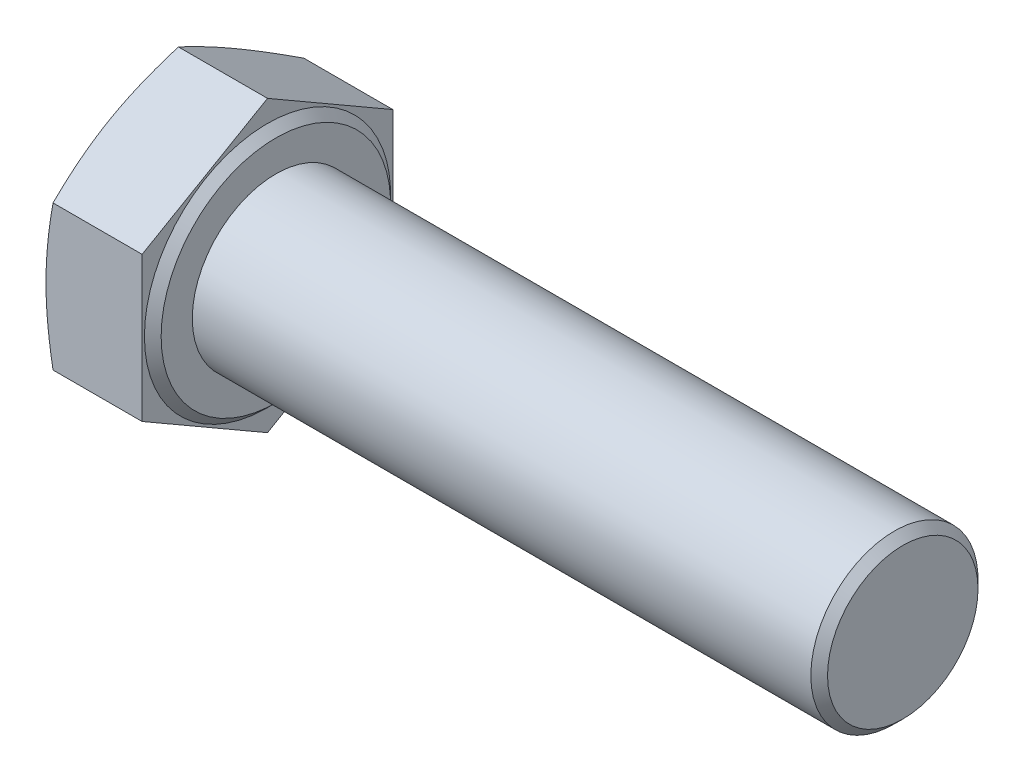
ISO-10303-21;
HEADER;
FILE_DESCRIPTION(('STEP AP214'),'2;1');
FILE_NAME('part.step','',(''),(''),'','','');
FILE_SCHEMA(('AUTOMOTIVE_DESIGN { 1 0 10303 214 1 1 1 1 }'));
ENDSEC;
DATA;
#1=APPLICATION_CONTEXT('core data for automotive mechanical design processes');
#2=APPLICATION_PROTOCOL_DEFINITION('international standard','automotive_design',2000,#1);
#3=PRODUCT_CONTEXT('',#1,'mechanical');
#4=PRODUCT('Part','Part','',(#3));
#5=PRODUCT_RELATED_PRODUCT_CATEGORY('part','',(#4));
#6=PRODUCT_DEFINITION_FORMATION('','',#4);
#7=PRODUCT_DEFINITION_CONTEXT('part definition',#1,'design');
#8=PRODUCT_DEFINITION('design','',#6,#7);
#9=PRODUCT_DEFINITION_SHAPE('','',#8);
#10=(LENGTH_UNIT() NAMED_UNIT(*) SI_UNIT(.MILLI.,.METRE.));
#11=(NAMED_UNIT(*) PLANE_ANGLE_UNIT() SI_UNIT($,.RADIAN.));
#12=(NAMED_UNIT(*) SI_UNIT($,.STERADIAN.) SOLID_ANGLE_UNIT());
#13=UNCERTAINTY_MEASURE_WITH_UNIT(LENGTH_MEASURE(1.E-05),#10,'distance_accuracy_value','');
#14=(GEOMETRIC_REPRESENTATION_CONTEXT(3) GLOBAL_UNCERTAINTY_ASSIGNED_CONTEXT((#13)) GLOBAL_UNIT_ASSIGNED_CONTEXT((#10,
#11,#12)) REPRESENTATION_CONTEXT('',''));
#15=CARTESIAN_POINT('',(0.,0.,0.));
#16=DIRECTION('',(0.,0.,1.));
#17=DIRECTION('',(1.,0.,0.));
#18=AXIS2_PLACEMENT_3D('',#15,#16,#17);
#19=CARTESIAN_POINT('',(7.5,0.,18.));
#20=DIRECTION('',(-1.,0.,0.));
#21=DIRECTION('',(0.,0.,1.));
#22=AXIS2_PLACEMENT_3D('',#19,#20,#21);
#23=PLANE('',#22);
#24=CARTESIAN_POINT('',(7.5,0.,0.));
#25=DIRECTION('',(-1.,0.,0.));
#26=DIRECTION('',(0.,0.,1.));
#27=AXIS2_PLACEMENT_3D('',#24,#25,#26);
#28=CIRCLE('',#27,8.235);
#29=CARTESIAN_POINT('',(7.5,0.,8.235));
#30=VERTEX_POINT('',#29);
#31=EDGE_CURVE('E273',#30,#30,#28,.T.);
#32=ORIENTED_EDGE('',*,*,#31,.F.);
#33=EDGE_LOOP('',(#32));
#34=FACE_BOUND('',#33,.T.);
#35=CARTESIAN_POINT('',(7.5,0.,0.));
#36=DIRECTION('',(-1.,0.,0.));
#37=DIRECTION('',(0.,0.,1.));
#38=AXIS2_PLACEMENT_3D('',#35,#36,#37);
#39=CIRCLE('',#38,6.);
#40=CARTESIAN_POINT('',(7.50000000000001,0.,6.));
#41=VERTEX_POINT('',#40);
#42=EDGE_CURVE('E157',#41,#41,#39,.F.);
#43=ORIENTED_EDGE('',*,*,#42,.F.);
#44=EDGE_LOOP('',(#43));
#45=FACE_BOUND('',#44,.T.);
#46=ADVANCED_FACE('F39',(#34,#45),#23,.F.);
#47=CARTESIAN_POINT('',(7.5,-5.19615242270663,9.));
#48=DIRECTION('',(0.,0.866025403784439,-0.5));
#49=DIRECTION('',(0.,0.5,0.866025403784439));
#50=AXIS2_PLACEMENT_3D('',#47,#48,#49);
#51=PLANE('',#50);
#52=CARTESIAN_POINT('',(0.506799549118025,-10.3924203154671,-0.00019999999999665));
#53=CARTESIAN_POINT('',(0.42844711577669,-10.1772266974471,0.372526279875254));
#54=CARTESIAN_POINT('',(0.357172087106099,-9.96132347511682,0.74648163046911));
#55=CARTESIAN_POINT('',(0.231774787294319,-9.52811323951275,1.49682376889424));
#56=CARTESIAN_POINT('',(0.177665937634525,-9.31080526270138,1.87321222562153));
#57=CARTESIAN_POINT('',(0.0901464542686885,-8.87719707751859,2.62424363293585));
#58=CARTESIAN_POINT('',(0.0565449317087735,-8.66090677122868,2.99886943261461));
#59=CARTESIAN_POINT('',(0.0114758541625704,-8.22782037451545,3.74899707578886));
#60=CARTESIAN_POINT('',(0.,-8.0110245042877,4.12449853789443));
#61=CARTESIAN_POINT('',(0.,-7.5774327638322,4.87550146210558));
#62=CARTESIAN_POINT('',(0.0114758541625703,-7.36063689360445,5.25100292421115));
#63=CARTESIAN_POINT('',(0.0565449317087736,-6.92755049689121,6.0011305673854));
#64=CARTESIAN_POINT('',(0.0901464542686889,-6.71126019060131,6.37575636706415));
#65=CARTESIAN_POINT('',(0.177665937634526,-6.27765200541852,7.12678777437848));
#66=CARTESIAN_POINT('',(0.23177478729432,-6.06034402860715,7.50317623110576));
#67=CARTESIAN_POINT('',(0.357172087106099,-5.62713379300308,8.25351836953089));
#68=CARTESIAN_POINT('',(0.428447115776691,-5.41123057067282,8.62747372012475));
#69=CARTESIAN_POINT('',(0.506799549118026,-5.19603695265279,9.0002));
#70=B_SPLINE_CURVE_WITH_KNOTS('',3,(#52,#53,#54,#55,#56,#57,#58,#59,#60,#61,#62,#63,#64,#65,#66,
#67,#68,#69),.UNSPECIFIED.,.F.,.F.,(4,2,2,2,2,2,2,2,4),(0.,1.3125188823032,2.62606145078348,
3.92718284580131,5.22781610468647,6.52844936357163,7.82957075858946,9.14311332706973,
10.4556322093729),.UNSPECIFIED.);
#71=CARTESIAN_POINT('',(0.506757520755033,-10.3923048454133,0.));
#72=VERTEX_POINT('',#71);
#73=CARTESIAN_POINT('',(0.,-7.79422863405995,4.5));
#74=VERTEX_POINT('',#73);
#75=EDGE_CURVE('E287',#72,#74,#70,.T.);
#76=ORIENTED_EDGE('',*,*,#75,.F.);
#77=DIRECTION('',(-1.,0.,0.));
#78=VECTOR('',#77,1.);
#79=CARTESIAN_POINT('',(7.5,-10.3923048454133,0.));
#80=LINE('',#79,#78);
#81=CARTESIAN_POINT('',(6.9,-10.3923048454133,0.));
#82=VERTEX_POINT('',#81);
#83=EDGE_CURVE('E150',#82,#72,#80,.T.);
#84=ORIENTED_EDGE('',*,*,#83,.F.);
#85=DIRECTION('',(0.,-0.5,-0.866025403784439));
#86=VECTOR('',#85,1.);
#87=CARTESIAN_POINT('',(6.9,-5.19615242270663,9.));
#88=LINE('',#87,#86);
#89=CARTESIAN_POINT('',(6.9,-5.19615242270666,9.));
#90=VERTEX_POINT('',#89);
#91=EDGE_CURVE('E141',#90,#82,#88,.T.);
#92=ORIENTED_EDGE('',*,*,#91,.F.);
#93=DIRECTION('',(-1.,0.,0.));
#94=VECTOR('',#93,1.);
#95=CARTESIAN_POINT('',(7.5,-5.19615242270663,9.));
#96=LINE('',#95,#94);
#97=CARTESIAN_POINT('',(0.506757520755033,-5.19615242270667,9.));
#98=VERTEX_POINT('',#97);
#99=EDGE_CURVE('E136',#90,#98,#96,.T.);
#100=ORIENTED_EDGE('',*,*,#99,.T.);
#101=EDGE_CURVE('E130',#74,#98,#70,.T.);
#102=ORIENTED_EDGE('',*,*,#101,.F.);
#103=EDGE_LOOP('',(#76,#84,#92,#100,#102));
#104=FACE_BOUND('',#103,.T.);
#105=ADVANCED_FACE('F173',(#104),#51,.F.);
#106=CARTESIAN_POINT('',(7.5,-10.3923048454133,0.));
#107=DIRECTION('',(0.,0.866025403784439,0.5));
#108=DIRECTION('',(0.,-0.5,0.866025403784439));
#109=AXIS2_PLACEMENT_3D('',#106,#107,#108);
#110=PLANE('',#109);
#111=CARTESIAN_POINT('',(0.506799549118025,-5.1960369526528,-9.00019999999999));
#112=CARTESIAN_POINT('',(0.42844711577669,-5.41123057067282,-8.62747372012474));
#113=CARTESIAN_POINT('',(0.357172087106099,-5.62713379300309,-8.25351836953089));
#114=CARTESIAN_POINT('',(0.231774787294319,-6.06034402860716,-7.50317623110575));
#115=CARTESIAN_POINT('',(0.177665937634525,-6.27765200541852,-7.12678777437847));
#116=CARTESIAN_POINT('',(0.0901464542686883,-6.71126019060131,-6.37575636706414));
#117=CARTESIAN_POINT('',(0.0565449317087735,-6.92755049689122,-6.00113056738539));
#118=CARTESIAN_POINT('',(0.0114758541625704,-7.36063689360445,-5.25100292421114));
#119=CARTESIAN_POINT('',(0.,-7.5774327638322,-4.87550146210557));
#120=CARTESIAN_POINT('',(0.,-8.0110245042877,-4.12449853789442));
#121=CARTESIAN_POINT('',(0.0114758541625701,-8.22782037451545,-3.74899707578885));
#122=CARTESIAN_POINT('',(0.0565449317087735,-8.66090677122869,-2.9988694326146));
#123=CARTESIAN_POINT('',(0.0901464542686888,-8.87719707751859,-2.62424363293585));
#124=CARTESIAN_POINT('',(0.177665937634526,-9.31080526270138,-1.87321222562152));
#125=CARTESIAN_POINT('',(0.23177478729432,-9.52811323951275,-1.49682376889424));
#126=CARTESIAN_POINT('',(0.3571720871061,-9.96132347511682,-0.746481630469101));
#127=CARTESIAN_POINT('',(0.428447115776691,-10.1772266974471,-0.372526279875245));
#128=CARTESIAN_POINT('',(0.506799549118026,-10.3924203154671,0.000200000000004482));
#129=B_SPLINE_CURVE_WITH_KNOTS('',3,(#111,#112,#113,#114,#115,#116,#117,#118,#119,#120,#121,
#122,#123,#124,#125,#126,#127,#128),.UNSPECIFIED.,.F.,.F.,(4,2,2,2,2,2,2,2,4),(0.,
1.3125188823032,2.62606145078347,3.92718284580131,5.22781610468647,6.52844936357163,
7.82957075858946,9.14311332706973,10.4556322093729),.UNSPECIFIED.);
#130=CARTESIAN_POINT('',(0.506757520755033,-5.19615242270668,-8.99999999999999));
#131=VERTEX_POINT('',#130);
#132=CARTESIAN_POINT('',(0.,-7.79422863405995,-4.5));
#133=VERTEX_POINT('',#132);
#134=EDGE_CURVE('E237',#131,#133,#129,.T.);
#135=ORIENTED_EDGE('',*,*,#134,.F.);
#136=DIRECTION('',(-1.,0.,0.));
#137=VECTOR('',#136,1.);
#138=CARTESIAN_POINT('',(7.5,-5.19615242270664,-8.99999999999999));
#139=LINE('',#138,#137);
#140=CARTESIAN_POINT('',(6.9,-5.19615242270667,-8.99999999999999));
#141=VERTEX_POINT('',#140);
#142=EDGE_CURVE('E147',#141,#131,#139,.T.);
#143=ORIENTED_EDGE('',*,*,#142,.F.);
#144=DIRECTION('',(0.,0.5,-0.866025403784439));
#145=VECTOR('',#144,1.);
#146=CARTESIAN_POINT('',(6.9,-10.3923048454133,0.));
#147=LINE('',#146,#145);
#148=EDGE_CURVE('E277',#82,#141,#147,.T.);
#149=ORIENTED_EDGE('',*,*,#148,.F.);
#150=ORIENTED_EDGE('',*,*,#83,.T.);
#151=EDGE_CURVE('E231',#133,#72,#129,.T.);
#152=ORIENTED_EDGE('',*,*,#151,.F.);
#153=EDGE_LOOP('',(#135,#143,#149,#150,#152));
#154=FACE_BOUND('',#153,.T.);
#155=ADVANCED_FACE('F179',(#154),#110,.F.);
#156=CARTESIAN_POINT('',(7.5,-5.19615242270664,-8.99999999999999));
#157=DIRECTION('',(0.,0.,1.));
#158=DIRECTION('',(1.,0.,0.));
#159=AXIS2_PLACEMENT_3D('',#156,#157,#158);
#160=PLANE('',#159);
#161=CARTESIAN_POINT('',(2.70791122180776,-13.7575845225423,-8.99999999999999));
#162=CARTESIAN_POINT('',(2.58392124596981,-13.3503919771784,-8.99999999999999));
#163=CARTESIAN_POINT('',(2.46137807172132,-12.9427506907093,-8.99999999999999));
#164=CARTESIAN_POINT('',(2.21998569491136,-12.126342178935,-8.99999999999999));
#165=CARTESIAN_POINT('',(2.10113678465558,-11.7175748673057,-8.99999999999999));
#166=CARTESIAN_POINT('',(1.8677356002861,-10.8979861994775,-8.99999999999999));
#167=CARTESIAN_POINT('',(1.75319175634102,-10.487162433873,-8.99999999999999));
#168=CARTESIAN_POINT('',(1.52974170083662,-9.66398668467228,-8.99999999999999));
#169=CARTESIAN_POINT('',(1.42083538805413,-9.25163472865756,-8.99999999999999));
#170=CARTESIAN_POINT('',(1.21135598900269,-8.43022329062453,-8.99999999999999));
#171=CARTESIAN_POINT('',(1.11069671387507,-8.02118589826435,-8.99999999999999));
#172=CARTESIAN_POINT('',(0.917948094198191,-7.20107569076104,-8.99999999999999));
#173=CARTESIAN_POINT('',(0.825858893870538,-6.79000284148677,-8.99999999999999));
#174=CARTESIAN_POINT('',(0.652397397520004,-5.96572973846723,-8.99999999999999));
#175=CARTESIAN_POINT('',(0.571021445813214,-5.55253026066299,-8.99999999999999));
#176=CARTESIAN_POINT('',(0.421464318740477,-4.72373239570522,-8.99999999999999));
#177=CARTESIAN_POINT('',(0.353282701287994,-4.30813408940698,-8.99999999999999));
#178=CARTESIAN_POINT('',(0.239635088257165,-3.52133656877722,-8.99999999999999));
#179=CARTESIAN_POINT('',(0.192479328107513,-3.15038372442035,-8.99999999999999));
#180=CARTESIAN_POINT('',(0.112655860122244,-2.40690946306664,-8.99999999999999));
#181=CARTESIAN_POINT('',(0.0799877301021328,-2.03438809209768,-8.99999999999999));
#182=CARTESIAN_POINT('',(0.0307127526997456,-1.28853238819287,-8.99999999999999));
#183=CARTESIAN_POINT('',(0.0140945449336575,-0.915198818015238,-8.99999999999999));
#184=CARTESIAN_POINT('',(-0.00223921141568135,-0.168158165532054,-8.99999999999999));
#185=CARTESIAN_POINT('',(-0.00195487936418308,0.20554891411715,-8.99999999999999));
#186=CARTESIAN_POINT('',(0.0155452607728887,0.95445613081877,-8.99999999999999));
#187=CARTESIAN_POINT('',(0.0328469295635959,1.32965422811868,-8.99999999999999));
#188=CARTESIAN_POINT('',(0.083585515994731,2.07894837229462,-8.99999999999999));
#189=CARTESIAN_POINT('',(0.117022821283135,2.45304439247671,-8.99999999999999));
#190=CARTESIAN_POINT('',(0.198468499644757,3.19994965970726,-8.99999999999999));
#191=CARTESIAN_POINT('',(0.246489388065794,3.57275752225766,-8.99999999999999));
#192=CARTESIAN_POINT('',(0.355154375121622,4.31650817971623,-8.99999999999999));
#193=CARTESIAN_POINT('',(0.415798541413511,4.68745096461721,-8.99999999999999));
#194=CARTESIAN_POINT('',(0.551226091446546,5.44699131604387,-8.99999999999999));
#195=CARTESIAN_POINT('',(0.62658769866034,5.83548486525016,-8.99999999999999));
#196=CARTESIAN_POINT('',(0.78701040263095,6.61047695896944,-8.99999999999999));
#197=CARTESIAN_POINT('',(0.872072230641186,6.99697535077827,-8.99999999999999));
#198=CARTESIAN_POINT('',(1.05010924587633,7.76825254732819,-8.99999999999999));
#199=CARTESIAN_POINT('',(1.14308673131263,8.15303081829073,-8.99999999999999));
#200=CARTESIAN_POINT('',(1.33544261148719,8.92096645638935,-8.99999999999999));
#201=CARTESIAN_POINT('',(1.43482085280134,9.30412386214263,-8.99999999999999));
#202=CARTESIAN_POINT('',(1.63891268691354,10.0695370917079,-8.99999999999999));
#203=CARTESIAN_POINT('',(1.74363296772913,10.4517911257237,-8.99999999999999));
#204=CARTESIAN_POINT('',(1.95733368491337,11.2151048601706,-8.99999999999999));
#205=CARTESIAN_POINT('',(2.06631413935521,11.5961645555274,-8.99999999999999));
#206=CARTESIAN_POINT('',(2.28775386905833,12.3571985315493,-8.99999999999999));
#207=CARTESIAN_POINT('',(2.40021254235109,12.7371729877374,-8.99999999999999));
#208=CARTESIAN_POINT('',(2.62802727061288,13.4962533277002,-8.99999999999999));
#209=CARTESIAN_POINT('',(2.74338334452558,13.8753592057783,-8.99999999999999));
#210=CARTESIAN_POINT('',(3.09047392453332,15.0032005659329,-8.99999999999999));
#211=CARTESIAN_POINT('',(3.32570086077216,15.7508610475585,-8.99999999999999));
#212=CARTESIAN_POINT('',(3.80282060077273,17.2440807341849,-8.99999999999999));
#213=CARTESIAN_POINT('',(4.04471372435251,17.9896398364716,-8.99999999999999));
#214=CARTESIAN_POINT('',(4.53246112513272,19.4763263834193,-8.99999999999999));
#215=CARTESIAN_POINT('',(4.77829688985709,20.2174599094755,-8.99999999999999));
#216=CARTESIAN_POINT('',(5.14977758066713,21.3282125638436,-8.99999999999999));
#217=CARTESIAN_POINT('',(5.27405392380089,21.698290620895,-8.99999999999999));
#218=CARTESIAN_POINT('',(5.52341076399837,22.4381747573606,-8.99999999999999));
#219=CARTESIAN_POINT('',(5.64849125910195,22.8079808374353,-8.99999999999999));
#220=CARTESIAN_POINT('',(5.77392011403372,23.1776687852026,-8.99999999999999));
#221=B_SPLINE_CURVE_WITH_KNOTS('',3,(#161,#162,#163,#164,#165,#166,#167,#168,#169,#170,#171,
#172,#173,#174,#175,#176,#177,#178,#179,#180,#181,#182,#183,#184,#185,#186,#187,#188,#189,#190,
#191,#192,#193,#194,#195,#196,#197,#198,#199,#200,#201,#202,#203,#204,#205,#206,#207,#208,#209,
#210,#211,#212,#213,#214,#215,#216,#217,#218,#219,#220),.UNSPECIFIED.,.F.,.F.,(4,2,2,2,2,2,2,2,
2,2,2,2,2,2,2,2,2,2,2,2,2,2,2,2,2,2,2,2,2,4),(0.,1.27696384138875,2.55402846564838,
3.83347577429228,5.1129001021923,6.37654978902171,7.64022073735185,8.90345935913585,
10.1666556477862,11.2882235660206,12.4097587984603,13.5304996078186,14.6512325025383,
15.777649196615,16.9040929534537,18.0315061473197,19.1589253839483,20.3459801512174,
21.5331244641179,22.7206146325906,23.9080763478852,25.0970630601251,26.2860548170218,
27.4748419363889,28.6636368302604,31.0149581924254,33.3663925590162,35.7089047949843,
36.8800665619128,38.0512254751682),.UNSPECIFIED.);
#222=CARTESIAN_POINT('',(0.506757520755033,5.19615242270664,-9.00000000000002));
#223=VERTEX_POINT('',#222);
#224=CARTESIAN_POINT('',(0.,0.,-9.));
#225=VERTEX_POINT('',#224);
#226=EDGE_CURVE('E312',#223,#225,#221,.F.);
#227=ORIENTED_EDGE('',*,*,#226,.F.);
#228=DIRECTION('',(-1.,0.,0.));
#229=VECTOR('',#228,1.);
#230=CARTESIAN_POINT('',(7.5,5.19615242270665,-8.99999999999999));
#231=LINE('',#230,#229);
#232=CARTESIAN_POINT('',(6.9,5.19615242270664,-9.00000000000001));
#233=VERTEX_POINT('',#232);
#234=EDGE_CURVE('E138',#233,#223,#231,.T.);
#235=ORIENTED_EDGE('',*,*,#234,.F.);
#236=DIRECTION('',(0.,1.,0.));
#237=VECTOR('',#236,1.);
#238=CARTESIAN_POINT('',(6.9,-5.19615242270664,-8.99999999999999));
#239=LINE('',#238,#237);
#240=EDGE_CURVE('E270',#141,#233,#239,.T.);
#241=ORIENTED_EDGE('',*,*,#240,.F.);
#242=ORIENTED_EDGE('',*,*,#142,.T.);
#243=EDGE_CURVE('E238',#225,#131,#221,.F.);
#244=ORIENTED_EDGE('',*,*,#243,.F.);
#245=EDGE_LOOP('',(#227,#235,#241,#242,#244));
#246=FACE_BOUND('',#245,.T.);
#247=ADVANCED_FACE('F247',(#246),#160,.F.);
#248=CARTESIAN_POINT('',(7.5,5.19615242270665,-8.99999999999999));
#249=DIRECTION('',(0.,-0.866025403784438,0.5));
#250=DIRECTION('',(0.,-0.5,-0.866025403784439));
#251=AXIS2_PLACEMENT_3D('',#248,#249,#250);
#252=PLANE('',#251);
#253=CARTESIAN_POINT('',(0.506799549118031,10.3924203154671,0.000199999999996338));
#254=CARTESIAN_POINT('',(0.428447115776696,10.1772266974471,-0.372526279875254));
#255=CARTESIAN_POINT('',(0.357172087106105,9.96132347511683,-0.74648163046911));
#256=CARTESIAN_POINT('',(0.231774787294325,9.52811323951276,-1.49682376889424));
#257=CARTESIAN_POINT('',(0.177665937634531,9.31080526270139,-1.87321222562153));
#258=CARTESIAN_POINT('',(0.0901464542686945,8.8771970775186,-2.62424363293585));
#259=CARTESIAN_POINT('',(0.0565449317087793,8.6609067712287,-2.9988694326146));
#260=CARTESIAN_POINT('',(0.0114758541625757,8.22782037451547,-3.74899707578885));
#261=CARTESIAN_POINT('',(0.,8.01102450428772,-4.12449853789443));
#262=CARTESIAN_POINT('',(0.,7.57743276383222,-4.87550146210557));
#263=CARTESIAN_POINT('',(0.0114758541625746,7.36063689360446,-5.25100292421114));
#264=CARTESIAN_POINT('',(0.0565449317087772,6.92755049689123,-6.00113056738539));
#265=CARTESIAN_POINT('',(0.0901464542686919,6.71126019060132,-6.37575636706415));
#266=CARTESIAN_POINT('',(0.177665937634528,6.27765200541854,-7.12678777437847));
#267=CARTESIAN_POINT('',(0.231774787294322,6.06034402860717,-7.50317623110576));
#268=CARTESIAN_POINT('',(0.357172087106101,5.6271337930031,-8.25351836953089));
#269=CARTESIAN_POINT('',(0.428447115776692,5.41123057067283,-8.62747372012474));
#270=CARTESIAN_POINT('',(0.506799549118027,5.19603695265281,-9.00019999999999));
#271=B_SPLINE_CURVE_WITH_KNOTS('',3,(#253,#254,#255,#256,#257,#258,#259,#260,#261,#262,#263,
#264,#265,#266,#267,#268,#269,#270),.UNSPECIFIED.,.F.,.F.,(4,2,2,2,2,2,2,2,4),(0.,
1.3125188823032,2.62606145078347,3.9271828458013,5.22781610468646,6.52844936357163,
7.82957075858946,9.14311332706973,10.4556322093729),.UNSPECIFIED.);
#272=CARTESIAN_POINT('',(0.506757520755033,10.3923048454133,0.));
#273=VERTEX_POINT('',#272);
#274=CARTESIAN_POINT('',(0.,7.79422863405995,-4.5));
#275=VERTEX_POINT('',#274);
#276=EDGE_CURVE('E225',#273,#275,#271,.T.);
#277=ORIENTED_EDGE('',*,*,#276,.F.);
#278=DIRECTION('',(-1.,0.,0.));
#279=VECTOR('',#278,1.);
#280=CARTESIAN_POINT('',(7.5,10.3923048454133,0.));
#281=LINE('',#280,#279);
#282=CARTESIAN_POINT('',(6.9,10.3923048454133,0.));
#283=VERTEX_POINT('',#282);
#284=EDGE_CURVE('E135',#283,#273,#281,.T.);
#285=ORIENTED_EDGE('',*,*,#284,.F.);
#286=DIRECTION('',(0.,0.5,0.866025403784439));
#287=VECTOR('',#286,1.);
#288=CARTESIAN_POINT('',(6.9,5.19615242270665,-8.99999999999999));
#289=LINE('',#288,#287);
#290=EDGE_CURVE('E267',#233,#283,#289,.T.);
#291=ORIENTED_EDGE('',*,*,#290,.F.);
#292=ORIENTED_EDGE('',*,*,#234,.T.);
#293=EDGE_CURVE('E264',#275,#223,#271,.T.);
#294=ORIENTED_EDGE('',*,*,#293,.F.);
#295=EDGE_LOOP('',(#277,#285,#291,#292,#294));
#296=FACE_BOUND('',#295,.T.);
#297=ADVANCED_FACE('F252',(#296),#252,.F.);
#298=CARTESIAN_POINT('',(7.5,10.3923048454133,0.));
#299=DIRECTION('',(0.,-0.866025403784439,-0.5));
#300=DIRECTION('',(0.,0.5,-0.866025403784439));
#301=AXIS2_PLACEMENT_3D('',#298,#299,#300);
#302=PLANE('',#301);
#303=CARTESIAN_POINT('',(0.506799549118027,5.19603695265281,9.0002));
#304=CARTESIAN_POINT('',(0.428447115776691,5.41123057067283,8.62747372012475));
#305=CARTESIAN_POINT('',(0.357172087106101,5.6271337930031,8.25351836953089));
#306=CARTESIAN_POINT('',(0.231774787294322,6.06034402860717,7.50317623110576));
#307=CARTESIAN_POINT('',(0.177665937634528,6.27765200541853,7.12678777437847));
#308=CARTESIAN_POINT('',(0.0901464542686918,6.71126019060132,6.37575636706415));
#309=CARTESIAN_POINT('',(0.056544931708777,6.92755049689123,6.00113056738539));
#310=CARTESIAN_POINT('',(0.0114758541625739,7.36063689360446,5.25100292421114));
#311=CARTESIAN_POINT('',(0.,7.57743276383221,4.87550146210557));
#312=CARTESIAN_POINT('',(0.,8.01102450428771,4.12449853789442));
#313=CARTESIAN_POINT('',(0.0114758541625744,8.22782037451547,3.74899707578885));
#314=CARTESIAN_POINT('',(0.0565449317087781,8.6609067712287,2.9988694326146));
#315=CARTESIAN_POINT('',(0.0901464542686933,8.87719707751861,2.62424363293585));
#316=CARTESIAN_POINT('',(0.17766593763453,9.31080526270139,1.87321222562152));
#317=CARTESIAN_POINT('',(0.231774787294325,9.52811323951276,1.49682376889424));
#318=CARTESIAN_POINT('',(0.357172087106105,9.96132347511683,0.746481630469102));
#319=CARTESIAN_POINT('',(0.428447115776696,10.1772266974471,0.372526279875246));
#320=CARTESIAN_POINT('',(0.506799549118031,10.3924203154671,-0.000200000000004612));
#321=B_SPLINE_CURVE_WITH_KNOTS('',3,(#303,#304,#305,#306,#307,#308,#309,#310,#311,#312,#313,
#314,#315,#316,#317,#318,#319,#320),.UNSPECIFIED.,.F.,.F.,(4,2,2,2,2,2,2,2,4),(0.,
1.3125188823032,2.62606145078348,3.92718284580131,5.22781610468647,6.52844936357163,
7.82957075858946,9.14311332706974,10.4556322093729),.UNSPECIFIED.);
#322=CARTESIAN_POINT('',(0.506757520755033,5.19615242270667,9.));
#323=VERTEX_POINT('',#322);
#324=CARTESIAN_POINT('',(0.,7.79422863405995,4.5));
#325=VERTEX_POINT('',#324);
#326=EDGE_CURVE('E115',#323,#325,#321,.T.);
#327=ORIENTED_EDGE('',*,*,#326,.F.);
#328=DIRECTION('',(-1.,0.,0.));
#329=VECTOR('',#328,1.);
#330=CARTESIAN_POINT('',(7.5,5.19615242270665,9.));
#331=LINE('',#330,#329);
#332=CARTESIAN_POINT('',(6.9,5.19615242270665,9.));
#333=VERTEX_POINT('',#332);
#334=EDGE_CURVE('E127',#333,#323,#331,.T.);
#335=ORIENTED_EDGE('',*,*,#334,.F.);
#336=DIRECTION('',(0.,-0.5,0.866025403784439));
#337=VECTOR('',#336,1.);
#338=CARTESIAN_POINT('',(6.9,10.3923048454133,0.));
#339=LINE('',#338,#337);
#340=EDGE_CURVE('E62',#283,#333,#339,.T.);
#341=ORIENTED_EDGE('',*,*,#340,.F.);
#342=ORIENTED_EDGE('',*,*,#284,.T.);
#343=EDGE_CURVE('E129',#325,#273,#321,.T.);
#344=ORIENTED_EDGE('',*,*,#343,.F.);
#345=EDGE_LOOP('',(#327,#335,#341,#342,#344));
#346=FACE_BOUND('',#345,.T.);
#347=ADVANCED_FACE('F126',(#346),#302,.F.);
#348=CARTESIAN_POINT('',(7.5,5.19615242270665,9.));
#349=DIRECTION('',(0.,0.,-1.));
#350=DIRECTION('',(0.,1.,0.));
#351=AXIS2_PLACEMENT_3D('',#348,#349,#350);
#352=PLANE('',#351);
#353=CARTESIAN_POINT('',(2.70791170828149,-13.7575861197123,9.00000000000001));
#354=CARTESIAN_POINT('',(2.58392170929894,-13.3503935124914,9.));
#355=CARTESIAN_POINT('',(2.46137851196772,-12.9427521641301,9.));
#356=CARTESIAN_POINT('',(2.21998608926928,-12.1263435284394,9.));
#357=CARTESIAN_POINT('',(2.1011371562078,-11.7175761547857,9.));
#358=CARTESIAN_POINT('',(1.86773592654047,-10.8979873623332,9.));
#359=CARTESIAN_POINT('',(1.75319206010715,-10.4871635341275,9.));
#360=CARTESIAN_POINT('',(1.52974196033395,-9.66398765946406,9.));
#361=CARTESIAN_POINT('',(1.42083562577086,-9.25163564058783,9.));
#362=CARTESIAN_POINT('',(1.21135618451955,-8.43022407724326,9.));
#363=CARTESIAN_POINT('',(1.11069688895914,-8.02118662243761,9.));
#364=CARTESIAN_POINT('',(0.917948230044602,-7.20107628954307,9.));
#365=CARTESIAN_POINT('',(0.825859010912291,-6.79000337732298,9.));
#366=CARTESIAN_POINT('',(0.652397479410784,-5.96573014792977,9.));
#367=CARTESIAN_POINT('',(0.571021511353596,-5.55253060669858,9.));
#368=CARTESIAN_POINT('',(0.421464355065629,-4.72373261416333,9.));
#369=CARTESIAN_POINT('',(0.353282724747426,-4.30813424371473,9.));
#370=CARTESIAN_POINT('',(0.239635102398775,-3.52133667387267,9.));
#371=CARTESIAN_POINT('',(0.192479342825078,-3.15038384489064,9.));
#372=CARTESIAN_POINT('',(0.112655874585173,-2.40690961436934,9.));
#373=CARTESIAN_POINT('',(0.0799877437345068,-2.03438825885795,9.));
#374=CARTESIAN_POINT('',(0.0307127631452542,-1.28853258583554,9.));
#375=CARTESIAN_POINT('',(0.0140945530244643,-0.915199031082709,9.));
#376=CARTESIAN_POINT('',(-0.00223920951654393,-0.168158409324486,9.));
#377=CARTESIAN_POINT('',(-0.00195488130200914,0.205548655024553,9.));
#378=CARTESIAN_POINT('',(0.0155452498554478,0.95445584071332,9.));
#379=CARTESIAN_POINT('',(0.0328469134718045,1.32965392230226,9.));
#380=CARTESIAN_POINT('',(0.0835854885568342,2.07894803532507,9.));
#381=CARTESIAN_POINT('',(0.117022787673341,2.45304404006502,9.));
#382=CARTESIAN_POINT('',(0.198468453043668,3.19994927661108,9.));
#383=CARTESIAN_POINT('',(0.246489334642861,3.57275712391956,9.));
#384=CARTESIAN_POINT('',(0.355154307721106,4.31650775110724,9.));
#385=CARTESIAN_POINT('',(0.415798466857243,4.68745052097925,9.));
#386=CARTESIAN_POINT('',(0.551226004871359,5.44699085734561,9.));
#387=CARTESIAN_POINT('',(0.626587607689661,5.83548440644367,9.));
#388=CARTESIAN_POINT('',(0.787010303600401,6.610476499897,9.));
#389=CARTESIAN_POINT('',(0.872072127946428,6.9969748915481,9.));
#390=CARTESIAN_POINT('',(1.05010913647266,7.76825208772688,9.));
#391=CARTESIAN_POINT('',(1.14308661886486,8.15303035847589,9.));
#392=CARTESIAN_POINT('',(1.33544249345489,8.92096599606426,9.));
#393=CARTESIAN_POINT('',(1.43482073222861,9.30412340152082,9.));
#394=CARTESIAN_POINT('',(1.63891256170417,10.0695366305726,9.));
#395=CARTESIAN_POINT('',(1.74363284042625,10.451790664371,9.));
#396=CARTESIAN_POINT('',(1.95733355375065,11.2151043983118,9.));
#397=CARTESIAN_POINT('',(2.06631400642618,11.5961640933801,9.));
#398=CARTESIAN_POINT('',(2.28775373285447,12.3571980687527,9.));
#399=CARTESIAN_POINT('',(2.40021240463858,12.7371725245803,8.99999999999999));
#400=CARTESIAN_POINT('',(2.62802713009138,13.4962528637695,8.99999999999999));
#401=CARTESIAN_POINT('',(2.74338320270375,13.8753587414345,8.99999999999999));
#402=CARTESIAN_POINT('',(3.09047378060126,15.0032001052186,8.99999999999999));
#403=CARTESIAN_POINT('',(3.32570071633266,15.7508605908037,8.99999999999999));
#404=CARTESIAN_POINT('',(3.80282045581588,17.2440802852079,8.99999999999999));
#405=CARTESIAN_POINT('',(4.04471357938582,17.9896393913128,8.99999999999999));
#406=CARTESIAN_POINT('',(4.53246098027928,19.4763259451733,8.99999999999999));
#407=CARTESIAN_POINT('',(4.77829674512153,20.2174594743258,8.99999999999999));
#408=CARTESIAN_POINT('',(5.14977743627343,21.3282121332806,8.99999999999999));
#409=CARTESIAN_POINT('',(5.27405377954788,21.6982901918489,8.99999999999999));
#410=CARTESIAN_POINT('',(5.52341062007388,22.4381743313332,8.99999999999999));
#411=CARTESIAN_POINT('',(5.64849111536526,22.8079804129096,8.99999999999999));
#412=CARTESIAN_POINT('',(5.77391997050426,23.1776683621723,8.99999999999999));
#413=B_SPLINE_CURVE_WITH_KNOTS('',3,(#353,#354,#355,#356,#357,#358,#359,#360,#361,#362,#363,
#364,#365,#366,#367,#368,#369,#370,#371,#372,#373,#374,#375,#376,#377,#378,#379,#380,#381,#382,
#383,#384,#385,#386,#387,#388,#389,#390,#391,#392,#393,#394,#395,#396,#397,#398,#399,#400,#401,
#402,#403,#404,#405,#406,#407,#408,#409,#410,#411,#412),.UNSPECIFIED.,.F.,.F.,(4,2,2,2,2,2,2,2,
2,2,2,2,2,2,2,2,2,2,2,2,2,2,2,2,2,2,2,2,2,4),(0.,1.27696403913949,2.55402886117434,
3.8334763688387,5.11290089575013,6.37655077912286,7.64022192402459,8.90346074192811,
10.1666572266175,11.28822509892,12.4097602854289,13.5305010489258,14.6512338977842,
15.7776505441,16.9040942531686,18.0315073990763,19.1589265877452,20.3459813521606,
21.5331256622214,22.7206158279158,23.9080775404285,25.0970642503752,26.2860560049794,
27.4748431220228,28.6636380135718,31.0149593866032,33.3663937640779,35.708906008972,
36.880067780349,38.0512266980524),.UNSPECIFIED.);
#414=CARTESIAN_POINT('',(0.,0.,9.));
#415=VERTEX_POINT('',#414);
#416=EDGE_CURVE('E121',#98,#415,#413,.T.);
#417=ORIENTED_EDGE('',*,*,#416,.F.);
#418=ORIENTED_EDGE('',*,*,#99,.F.);
#419=DIRECTION('',(0.,-1.,0.));
#420=VECTOR('',#419,1.);
#421=CARTESIAN_POINT('',(6.9,5.19615242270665,9.));
#422=LINE('',#421,#420);
#423=EDGE_CURVE('E134',#333,#90,#422,.T.);
#424=ORIENTED_EDGE('',*,*,#423,.F.);
#425=ORIENTED_EDGE('',*,*,#334,.T.);
#426=EDGE_CURVE('E112',#415,#323,#413,.T.);
#427=ORIENTED_EDGE('',*,*,#426,.F.);
#428=EDGE_LOOP('',(#417,#418,#424,#425,#427));
#429=FACE_BOUND('',#428,.T.);
#430=ADVANCED_FACE('F132',(#429),#352,.F.);
#431=CARTESIAN_POINT('',(6.9,8.835,0.));
#432=DIRECTION('',(1.,0.,0.));
#433=DIRECTION('',(0.,0.,-1.));
#434=AXIS2_PLACEMENT_3D('',#431,#432,#433);
#435=PLANE('',#434);
#436=CARTESIAN_POINT('',(6.9,0.,0.));
#437=DIRECTION('',(-1.,0.,0.));
#438=DIRECTION('',(0.,0.,1.));
#439=AXIS2_PLACEMENT_3D('',#436,#437,#438);
#440=CIRCLE('',#439,8.835);
#441=CARTESIAN_POINT('',(6.9,0.,8.835));
#442=VERTEX_POINT('',#441);
#443=EDGE_CURVE('E268',#442,#442,#440,.T.);
#444=ORIENTED_EDGE('',*,*,#443,.T.);
#445=EDGE_LOOP('',(#444));
#446=FACE_BOUND('',#445,.T.);
#447=ORIENTED_EDGE('',*,*,#91,.T.);
#448=ORIENTED_EDGE('',*,*,#148,.T.);
#449=ORIENTED_EDGE('',*,*,#240,.T.);
#450=ORIENTED_EDGE('',*,*,#290,.T.);
#451=ORIENTED_EDGE('',*,*,#340,.T.);
#452=ORIENTED_EDGE('',*,*,#423,.T.);
#453=EDGE_LOOP('',(#447,#448,#449,#450,#451,#452));
#454=FACE_BOUND('',#453,.T.);
#455=ADVANCED_FACE('F185',(#446,#454),#435,.T.);
#456=CARTESIAN_POINT('',(6.9,0.,0.));
#457=DIRECTION('',(-1.,0.,0.));
#458=DIRECTION('',(0.,0.,1.));
#459=AXIS2_PLACEMENT_3D('',#456,#457,#458);
#460=CONICAL_SURFACE('',#459,8.835,0.785398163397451);
#461=ORIENTED_EDGE('',*,*,#31,.T.);
#462=EDGE_LOOP('',(#461));
#463=FACE_BOUND('',#462,.T.);
#464=ORIENTED_EDGE('',*,*,#443,.F.);
#465=EDGE_LOOP('',(#464));
#466=FACE_BOUND('',#465,.T.);
#467=ADVANCED_FACE('F213',(#463,#466),#460,.T.);
#468=CARTESIAN_POINT('',(0.,0.,0.));
#469=DIRECTION('',(1.,0.,0.));
#470=DIRECTION('',(0.,0.,-1.));
#471=AXIS2_PLACEMENT_3D('',#468,#469,#470);
#472=CONICAL_SURFACE('',#471,9.,1.22173047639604);
#473=ORIENTED_EDGE('',*,*,#101,.T.);
#474=ORIENTED_EDGE('',*,*,#416,.T.);
#475=CARTESIAN_POINT('',(0.,0.,0.));
#476=DIRECTION('',(-1.,0.,0.));
#477=DIRECTION('',(0.,0.,1.));
#478=AXIS2_PLACEMENT_3D('',#475,#476,#477);
#479=CIRCLE('',#478,9.);
#480=EDGE_CURVE('E54',#74,#415,#479,.T.);
#481=ORIENTED_EDGE('',*,*,#480,.F.);
#482=EDGE_LOOP('',(#473,#474,#481));
#483=FACE_BOUND('',#482,.T.);
#484=ADVANCED_FACE('F291',(#483),#472,.T.);
#485=ORIENTED_EDGE('',*,*,#151,.T.);
#486=ORIENTED_EDGE('',*,*,#75,.T.);
#487=EDGE_CURVE('E155',#133,#74,#479,.T.);
#488=ORIENTED_EDGE('',*,*,#487,.F.);
#489=EDGE_LOOP('',(#485,#486,#488));
#490=FACE_BOUND('',#489,.T.);
#491=ADVANCED_FACE('F300',(#490),#472,.T.);
#492=ORIENTED_EDGE('',*,*,#243,.T.);
#493=ORIENTED_EDGE('',*,*,#134,.T.);
#494=EDGE_CURVE('E295',#225,#133,#479,.T.);
#495=ORIENTED_EDGE('',*,*,#494,.F.);
#496=EDGE_LOOP('',(#492,#493,#495));
#497=FACE_BOUND('',#496,.T.);
#498=ADVANCED_FACE('F211',(#497),#472,.T.);
#499=ORIENTED_EDGE('',*,*,#226,.T.);
#500=EDGE_CURVE('E296',#275,#225,#479,.T.);
#501=ORIENTED_EDGE('',*,*,#500,.F.);
#502=ORIENTED_EDGE('',*,*,#293,.T.);
#503=EDGE_LOOP('',(#499,#501,#502));
#504=FACE_BOUND('',#503,.T.);
#505=ADVANCED_FACE('F206',(#504),#472,.T.);
#506=ORIENTED_EDGE('',*,*,#276,.T.);
#507=EDGE_CURVE('E156',#325,#275,#479,.T.);
#508=ORIENTED_EDGE('',*,*,#507,.F.);
#509=ORIENTED_EDGE('',*,*,#343,.T.);
#510=EDGE_LOOP('',(#506,#508,#509));
#511=FACE_BOUND('',#510,.T.);
#512=ADVANCED_FACE('F210',(#511),#472,.T.);
#513=ORIENTED_EDGE('',*,*,#326,.T.);
#514=CARTESIAN_POINT('',(0.,0.,0.));
#515=DIRECTION('',(-1.,0.,0.));
#516=DIRECTION('',(0.,0.,1.));
#517=AXIS2_PLACEMENT_3D('',#514,#515,#516);
#518=CIRCLE('',#517,9.);
#519=EDGE_CURVE('E117',#415,#325,#518,.T.);
#520=ORIENTED_EDGE('',*,*,#519,.F.);
#521=ORIENTED_EDGE('',*,*,#426,.T.);
#522=EDGE_LOOP('',(#513,#520,#521));
#523=FACE_BOUND('',#522,.T.);
#524=ADVANCED_FACE('F114',(#523),#472,.T.);
#525=CARTESIAN_POINT('',(0.,0.,18.));
#526=DIRECTION('',(-1.,0.,0.));
#527=DIRECTION('',(0.,0.,1.));
#528=AXIS2_PLACEMENT_3D('',#525,#526,#527);
#529=PLANE('',#528);
#530=ORIENTED_EDGE('',*,*,#480,.T.);
#531=ORIENTED_EDGE('',*,*,#519,.T.);
#532=ORIENTED_EDGE('',*,*,#507,.T.);
#533=ORIENTED_EDGE('',*,*,#500,.T.);
#534=ORIENTED_EDGE('',*,*,#494,.T.);
#535=ORIENTED_EDGE('',*,*,#487,.T.);
#536=EDGE_LOOP('',(#530,#531,#532,#533,#534,#535));
#537=FACE_BOUND('',#536,.T.);
#538=ADVANCED_FACE('F187',(#537),#529,.T.);
#539=CARTESIAN_POINT('',(52.5,0.,0.));
#540=DIRECTION('',(-1.,0.,0.));
#541=DIRECTION('',(0.,0.,1.));
#542=AXIS2_PLACEMENT_3D('',#539,#540,#541);
#543=CYLINDRICAL_SURFACE('',#542,6.);
#544=CARTESIAN_POINT('',(51.9,0.,0.));
#545=DIRECTION('',(1.,0.,0.));
#546=DIRECTION('',(0.,0.,-1.));
#547=AXIS2_PLACEMENT_3D('',#544,#545,#546);
#548=CIRCLE('',#547,6.);
#549=CARTESIAN_POINT('',(51.9,0.,6.));
#550=VERTEX_POINT('',#549);
#551=EDGE_CURVE('E11',#550,#550,#548,.F.);
#552=CARTESIAN_POINT('',(51.9,0.,6.));
#553=CARTESIAN_POINT('',(51.4375,0.,6.));
#554=CARTESIAN_POINT('',(50.975,0.,6.));
#555=CARTESIAN_POINT('',(50.05,0.,6.));
#556=CARTESIAN_POINT('',(49.5875,0.,6.));
#557=CARTESIAN_POINT('',(48.6625,0.,6.));
#558=CARTESIAN_POINT('',(48.2,0.,6.));
#559=CARTESIAN_POINT('',(47.275,0.,6.));
#560=CARTESIAN_POINT('',(46.8125,0.,6.));
#561=CARTESIAN_POINT('',(45.8875,0.,6.));
#562=CARTESIAN_POINT('',(45.425,0.,6.));
#563=CARTESIAN_POINT('',(44.5,0.,6.));
#564=CARTESIAN_POINT('',(44.0375,0.,6.));
#565=CARTESIAN_POINT('',(43.1125,0.,6.));
#566=CARTESIAN_POINT('',(42.65,0.,6.));
#567=CARTESIAN_POINT('',(41.725,0.,6.));
#568=CARTESIAN_POINT('',(41.2625,0.,6.));
#569=CARTESIAN_POINT('',(40.3375,0.,6.));
#570=CARTESIAN_POINT('',(39.875,0.,6.));
#571=CARTESIAN_POINT('',(38.95,0.,6.));
#572=CARTESIAN_POINT('',(38.4875,0.,6.));
#573=CARTESIAN_POINT('',(37.5625,0.,6.));
#574=CARTESIAN_POINT('',(37.1,0.,6.));
#575=CARTESIAN_POINT('',(36.175,0.,6.));
#576=CARTESIAN_POINT('',(35.7125,0.,6.));
#577=CARTESIAN_POINT('',(34.7875,0.,6.));
#578=CARTESIAN_POINT('',(34.325,0.,6.));
#579=CARTESIAN_POINT('',(33.4,0.,6.));
#580=CARTESIAN_POINT('',(32.9375,0.,6.));
#581=CARTESIAN_POINT('',(32.0125,0.,6.));
#582=CARTESIAN_POINT('',(31.55,0.,6.));
#583=CARTESIAN_POINT('',(30.625,0.,6.));
#584=CARTESIAN_POINT('',(30.1625,0.,6.));
#585=CARTESIAN_POINT('',(29.2375,0.,6.));
#586=CARTESIAN_POINT('',(28.775,0.,6.));
#587=CARTESIAN_POINT('',(27.85,0.,6.));
#588=CARTESIAN_POINT('',(27.3875,0.,6.));
#589=CARTESIAN_POINT('',(26.4625,0.,6.));
#590=CARTESIAN_POINT('',(26.,0.,6.));
#591=CARTESIAN_POINT('',(25.075,0.,6.));
#592=CARTESIAN_POINT('',(24.6125,0.,6.));
#593=CARTESIAN_POINT('',(23.6875,0.,6.));
#594=CARTESIAN_POINT('',(23.225,0.,6.));
#595=CARTESIAN_POINT('',(22.3,0.,6.));
#596=CARTESIAN_POINT('',(21.8375,0.,6.));
#597=CARTESIAN_POINT('',(20.9125,0.,6.));
#598=CARTESIAN_POINT('',(20.45,0.,6.));
#599=CARTESIAN_POINT('',(19.525,0.,6.));
#600=CARTESIAN_POINT('',(19.0625,0.,6.));
#601=CARTESIAN_POINT('',(18.1375,0.,6.));
#602=CARTESIAN_POINT('',(17.675,0.,6.));
#603=CARTESIAN_POINT('',(16.75,0.,6.));
#604=CARTESIAN_POINT('',(16.2875,0.,6.));
#605=CARTESIAN_POINT('',(15.3625,0.,6.));
#606=CARTESIAN_POINT('',(14.9,0.,6.));
#607=CARTESIAN_POINT('',(13.975,0.,6.));
#608=CARTESIAN_POINT('',(13.5125,0.,6.));
#609=CARTESIAN_POINT('',(12.5875,0.,6.));
#610=CARTESIAN_POINT('',(12.125,0.,6.));
#611=CARTESIAN_POINT('',(11.2,0.,6.));
#612=CARTESIAN_POINT('',(10.7375,0.,6.));
#613=CARTESIAN_POINT('',(9.81250000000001,0.,6.));
#614=CARTESIAN_POINT('',(9.35000000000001,0.,6.));
#615=CARTESIAN_POINT('',(8.42500000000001,0.,6.));
#616=CARTESIAN_POINT('',(7.96250000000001,0.,6.));
#617=CARTESIAN_POINT('',(7.50000000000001,0.,6.));
#618=B_SPLINE_CURVE_WITH_KNOTS('',3,(#552,#553,#554,#555,#556,#557,#558,#559,#560,#561,#562,
#563,#564,#565,#566,#567,#568,#569,#570,#571,#572,#573,#574,#575,#576,#577,#578,#579,#580,#581,
#582,#583,#584,#585,#586,#587,#588,#589,#590,#591,#592,#593,#594,#595,#596,#597,#598,#599,#600,
#601,#602,#603,#604,#605,#606,#607,#608,#609,#610,#611,#612,#613,#614,#615,#616,#617),
.UNSPECIFIED.,.F.,.F.,(4,2,2,2,2,2,2,2,2,2,2,2,2,2,2,2,2,2,2,2,2,2,2,2,2,2,2,2,2,2,2,2,4),(0.,
1.38750000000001,2.77500000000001,4.16250000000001,5.55000000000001,6.93750000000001,
8.32500000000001,9.71250000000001,11.1,12.4875,13.875,15.2625,16.65,18.0375,19.425,20.8125,22.2,
23.5875,24.975,26.3625,27.75,29.1375,30.525,31.9125,33.3,34.6875,36.075,37.4625,38.85,40.2375,
41.625,43.0125,44.4),.UNSPECIFIED.);
#619=EDGE_CURVE('BSEAM169',#550,#41,#618,.T.);
#620=ORIENTED_EDGE('',*,*,#551,.T.);
#621=ORIENTED_EDGE('',*,*,#42,.T.);
#622=ORIENTED_EDGE('',*,*,#619,.T.);
#623=ORIENTED_EDGE('',*,*,#619,.F.);
#624=EDGE_LOOP('',(#620,#622,#621,#623));
#625=FACE_BOUND('',#624,.T.);
#626=ADVANCED_FACE('F169',(#625),#543,.T.);
#627=CARTESIAN_POINT('',(52.5,0.,0.));
#628=DIRECTION('',(1.,0.,0.));
#629=DIRECTION('',(0.,0.,-1.));
#630=AXIS2_PLACEMENT_3D('',#627,#628,#629);
#631=PLANE('',#630);
#632=CARTESIAN_POINT('',(52.5,0.,0.));
#633=DIRECTION('',(1.,0.,0.));
#634=DIRECTION('',(0.,0.,-1.));
#635=AXIS2_PLACEMENT_3D('',#632,#633,#634);
#636=CIRCLE('',#635,5.40000000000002);
#637=CARTESIAN_POINT('',(52.5,0.,-5.40000000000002));
#638=VERTEX_POINT('',#637);
#639=EDGE_CURVE('E47',#638,#638,#636,.T.);
#640=ORIENTED_EDGE('',*,*,#639,.T.);
#641=EDGE_LOOP('',(#640));
#642=FACE_BOUND('',#641,.T.);
#643=ADVANCED_FACE('F162',(#642),#631,.T.);
#644=CARTESIAN_POINT('',(52.5,0.,0.));
#645=DIRECTION('',(-1.,0.,0.));
#646=DIRECTION('',(0.,0.,1.));
#647=AXIS2_PLACEMENT_3D('',#644,#645,#646);
#648=CONICAL_SURFACE('',#647,5.40000000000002,0.785398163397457);
#649=ORIENTED_EDGE('',*,*,#551,.F.);
#650=EDGE_LOOP('',(#649));
#651=FACE_BOUND('',#650,.T.);
#652=ORIENTED_EDGE('',*,*,#639,.F.);
#653=EDGE_LOOP('',(#652));
#654=FACE_BOUND('',#653,.T.);
#655=ADVANCED_FACE('F41',(#651,#654),#648,.T.);
#656=CLOSED_SHELL('',(#46,#105,#155,#247,#297,#347,#430,#455,#467,#484,#491,#498,#505,#512,#524,
#538,#626,#643,#655));
#657=MANIFOLD_SOLID_BREP('B2',#656);
#658=ADVANCED_BREP_SHAPE_REPRESENTATION('',(#18,#657),#14);
#659=SHAPE_DEFINITION_REPRESENTATION(#9,#658);
ENDSEC;
END-ISO-10303-21;
